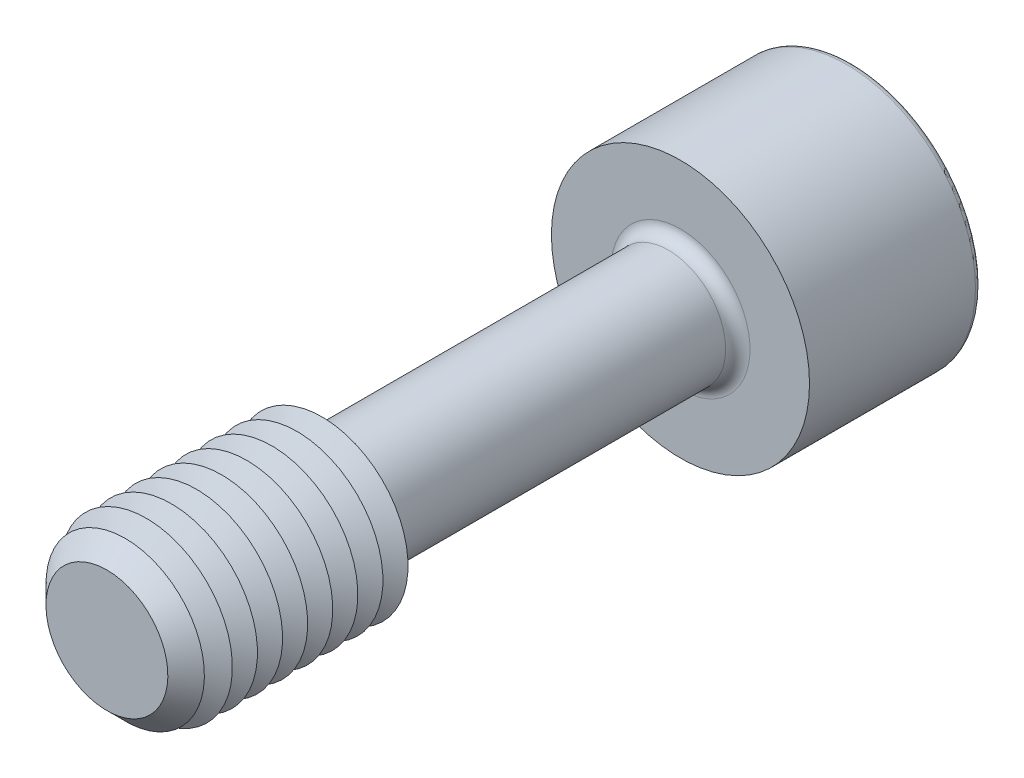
from build123d import *

# Parameters (mm, degrees)
SKETCH1_R       = 4
EXTRUDE1_DEPTH  = 20
CHAMFER1_SIZE   = 1.75
SKETCH3_R       = 9
EXTRUDE2_DEPTH  = 12
EXTRUDE3_DEPTH  = 10
FILLET1_R       = 0.85
FILLET2_R       = 0.425
LPATTERN1_COUNT = 8
LPATTERN1_PITCH = 1.75


with BuildPart() as part:
    # Sketch1 → Extrude1 (new, symmetric)
    with BuildSketch(Plane.XY):
        Circle(SKETCH1_R)
    extrude(amount=EXTRUDE1_DEPTH, both=True)

    # Sketch2 → Revolve1 (revolve)
    with BuildSketch(Plane(origin=(0, 0, 0), x_dir=(0, 0, -1), z_dir=(1, 0, 0))):
        Polygon((-20, 0), (-20, 6), (-5, 6), (-3.845299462, 4), (-3.845299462, 0), align=None)
    revolve(axis=Axis((0, 0, 3.845299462), (0, 0, 1)))

    # Chamfer1
    chamfer1_edges = [part.edges().sort_by_distance(p)[0] for p in [
        (0, -6, 20),
    ]]
    chamfer(chamfer1_edges, length=CHAMFER1_SIZE)

    # Sketch3 → Extrude2 (add)
    with BuildSketch(Plane(origin=(0, 0, -20), x_dir=(-1, 0, 0), z_dir=(0, 0, -1))):
        Circle(SKETCH3_R)
    extrude(amount=EXTRUDE2_DEPTH)

    # Sketch4 → Extrude3 (cut)
    with BuildSketch(Plane(origin=(-13.7, 0, -32), x_dir=(1, 0, 0), z_dir=(0, 0, 1))):
        Polygon((10.813248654, -5), (16.586751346, -5), (19.473502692, 0), (16.586751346, 5), (10.813248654, 5), (7.926497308, 0), align=None)
    extrude(amount=EXTRUDE3_DEPTH, mode=Mode.SUBTRACT)

    # Fillet1
    fillet1_edges = [part.edges().sort_by_distance(p)[0] for p in [
        (-4, 0, -20),
    ]]
    fillet(fillet1_edges, radius=FILLET1_R)

    # Fillet2
    fillet2_edges = [part.edges().sort_by_distance(p)[0] for p in [
        (9, 0, -32),
    ]]
    fillet(fillet2_edges, radius=FILLET2_R)

    # Sketch5 → Cut-Revolve1 (revolve, cut)
    with BuildSketch(Plane(origin=(0, 0, 0), x_dir=(0, 0, -1), z_dir=(1, 0, 0)), mode=Mode.PRIVATE) as cut_revolve1_sk:
        Polygon((22, 0), (22, -5), (19.113248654, 0), align=None)
    revolve(cut_revolve1_sk.sketch.rotate(Axis((0, 0, -19.113248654), (0, 0, -1)), 90), axis=Axis((0, 0, -19.113248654), (0, 0, -1)), mode=Mode.SUBTRACT)

    # Sketch7 → Cut-Revolve2 (revolve, cut)
    with BuildSketch(Plane(origin=(0, 0, 0), x_dir=(0, 0, -1), z_dir=(1, 0, 0)), mode=Mode.PRIVATE) as cut_revolve2_sk:
        Polygon((-5, 6), (-5.875, 4.484455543), (-6.75, 6), align=None)
    cut_revolve2 = revolve(cut_revolve2_sk.sketch.rotate(Axis((0, 0, -1.332048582), (0, 0, 1)), 90), axis=Axis((0, 0, -1.332048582), (0, 0, 1)), mode=Mode.SUBTRACT)

    # LPattern1: Cut-Revolve2 ×8
    with Locations(*[(0, 0, i * LPATTERN1_PITCH) for i in range(1, LPATTERN1_COUNT)]):
        add(cut_revolve2, mode=Mode.SUBTRACT)


solid = part.part
